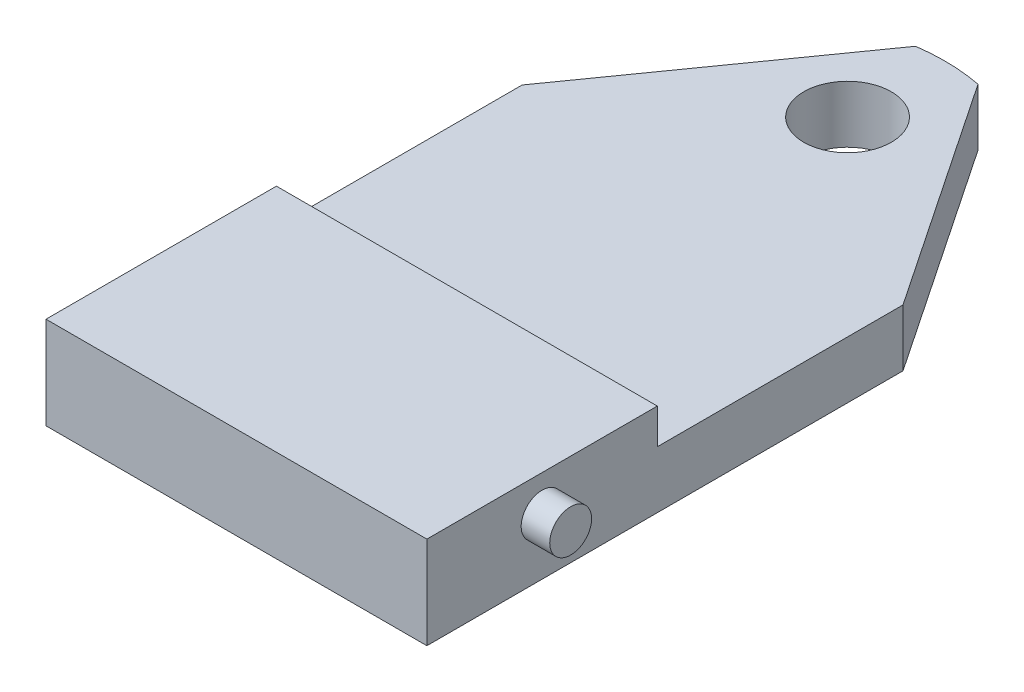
from build123d import *

# Parameters (mm, degrees)
SKETCH1_R           = 2.3
BOSS_EXTRUDE1_DEPTH = 3
BOSS_EXTRUDE3_START = -20
SKETCH2_W           = 12.1
SKETCH2_H           = 1.85
BOSS_EXTRUDE3_DEPTH = 20
SKETCH3_R           = 1.1
BOSS_EXTRUDE4_DEPTH = 1.5


with BuildPart() as part:
    # Sketch1 → Boss-Extrude1 (new body)
    with BuildSketch(Plane(origin=(0, 0, 0), x_dir=(1, 0, 0), z_dir=(0, 1, 0))):
        with BuildLine():
            Line((0, -15), (0, -40))
            Line((0, -40), (20, -40))
            Line((20, -40), (20, -15))
            Line((20, -15), (11.932902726, -2.994697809))
            ThreePointArc((11.932902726, -2.994697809), (10.253192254, -2.812964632), (8.566530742, -2.911082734))
            Line((8.566530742, -2.911082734), (0, -15))
        make_face()
        with Locations(Location((10, -7.911782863, 0), (0, 0, 270))):
            Circle(SKETCH1_R, mode=Mode.SUBTRACT)
    extrude(amount=BOSS_EXTRUDE1_DEPTH)

    # Sketch2 → Boss-Extrude3 (add)
    with BuildSketch(Plane(origin=(20, 0, 0), x_dir=(0, 0, -1), z_dir=(1, 0, 0)).offset(BOSS_EXTRUDE3_START)):
        with Locations((-33.95, 3.925)):
            Rectangle(SKETCH2_W, SKETCH2_H)
    extrude(amount=BOSS_EXTRUDE3_DEPTH)

    # Sketch3 → Boss-Extrude4 (add)
    with BuildSketch(Plane(origin=(20, 0, 0), x_dir=(0, 0, -1), z_dir=(1, 0, 0))):
        with Locations(Location((-33.95, 2.95, 0), (0, 0, 180))):
            Circle(SKETCH3_R)
    extrude(amount=BOSS_EXTRUDE4_DEPTH)


solid = part.part
